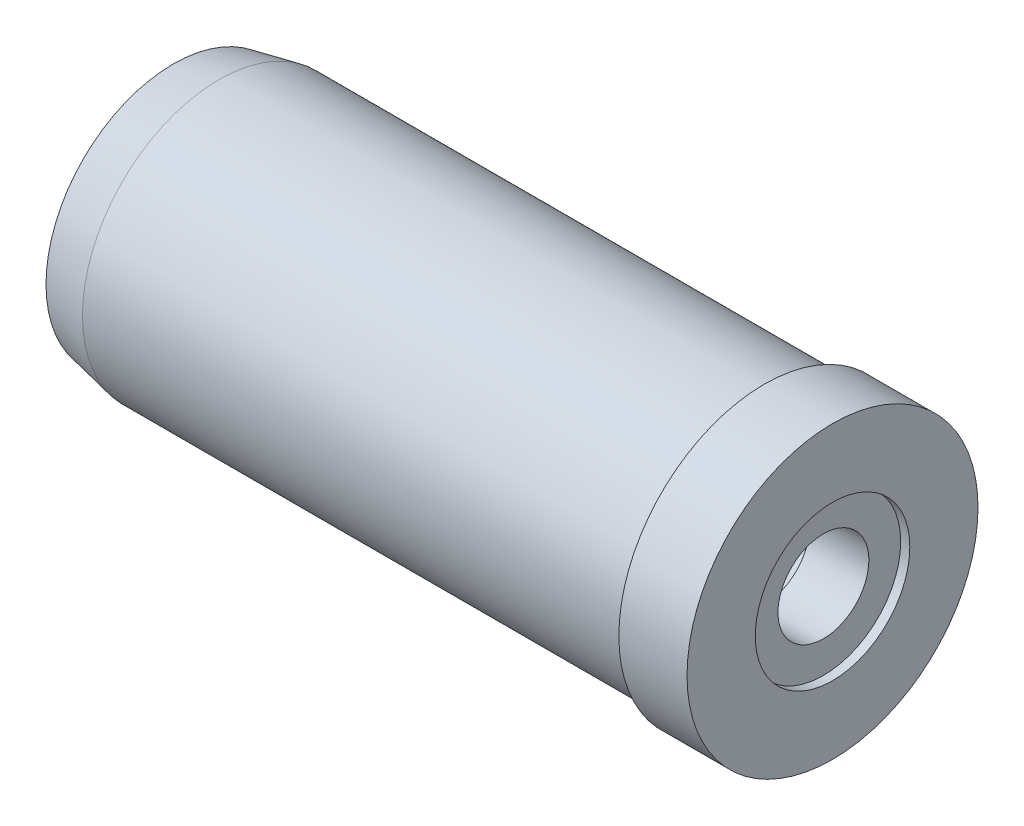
from build123d import *


with BuildPart() as part:
    # Esquisse1 → R_volution1 (revolve)
    with BuildSketch(Plane.XY, mode=Mode.PRIVATE) as r_volution1_sk:
        Polygon((175.54977417, 10), (175.54977417, 17), (177.54977417, 17), (177.54977417, 32), (162.54977417, 32), (162.54977417, 30), (42.566441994, 30), (32.54977417, 28), (32.54977417, 24), (162.54977417, 24), (162.54977417, 10), align=None)
    revolve(r_volution1_sk.sketch.rotate(Axis((32.54977417, 0, 0), (1, 0, 0)), 270), axis=Axis((32.54977417, 0, 0), (1, 0, 0)))


solid = part.part
